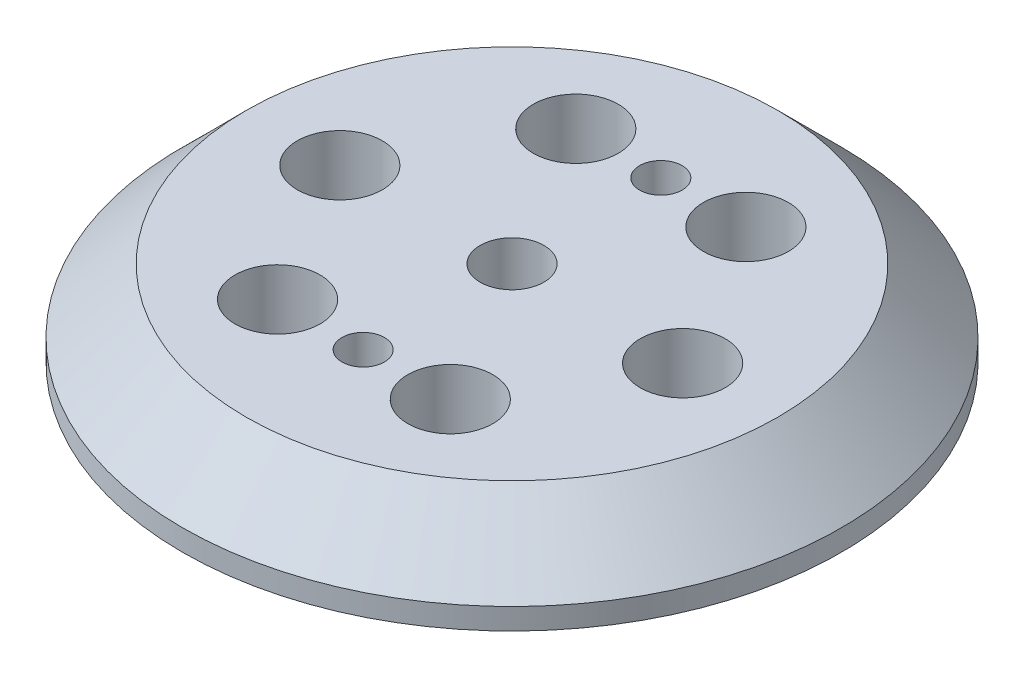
from build123d import *

# Parameters (mm, degrees)
SKETCH1_R           = 15.5
BOSS_EXTRUDE1_DEPTH = 4
CHAMFER1_SIZE       = 3
SKETCH2_R           = 2
CUT_EXTRUDE1_DEPTH  = 4
SKETCH3_R           = 1.5
CUT_EXTRUDE2_DEPTH  = 4
SKETCH4_R           = 1
CUT_EXTRUDE3_DEPTH  = 4


with BuildPart() as part:
    # Sketch1 → Boss-Extrude1 (new body)
    with BuildSketch(Plane(origin=(0, 0, 0), x_dir=(1, 0, 0), z_dir=(0, 1, 0))):
        with Locations(Location((0, 0, 0), (0, 0, 270))):
            Circle(SKETCH1_R)
    extrude(amount=BOSS_EXTRUDE1_DEPTH)

    # Chamfer1
    chamfer1_edges = [part.edges().sort_by_distance(p)[0] for p in [
        (0, 4, -15.5),
    ]]
    chamfer(chamfer1_edges, length=CHAMFER1_SIZE)

    # Sketch2 → Cut-Extrude1 (cut)
    with BuildSketch(Plane(origin=(0, 4, 0), x_dir=(1, 0, 0), z_dir=(0, 1, 0))):
        with Locations(Location((4, 7, 0), (0, 0, 270))):
            Circle(SKETCH2_R)
        with Locations(Location((-4, 7, 0), (0, 0, 270))):
            Circle(SKETCH2_R)
        with Locations(Location((8.062177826, -0.035898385, 0), (0, 0, 270))):
            Circle(SKETCH2_R)
        with Locations(Location((4.062177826, -6.964101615, 0), (0, 0, 270))):
            Circle(SKETCH2_R)
        with Locations(Location((-4.062177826, -6.964101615, 0), (0, 0, 270))):
            Circle(SKETCH2_R)
        with Locations(Location((-8.062177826, -0.035898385, 0), (0, 0, 270))):
            Circle(SKETCH2_R)
    extrude(amount=-CUT_EXTRUDE1_DEPTH, mode=Mode.SUBTRACT)

    # Sketch3 → Cut-Extrude2 (cut)
    with BuildSketch(Plane(origin=(0, 4, 0), x_dir=(1, 0, 0), z_dir=(0, 1, 0))):
        with Locations(Location((0, 0, 0), (0, 0, 270))):
            Circle(SKETCH3_R)
    extrude(amount=-CUT_EXTRUDE2_DEPTH, mode=Mode.SUBTRACT)

    # Sketch4 → Cut-Extrude3 (cut)
    with BuildSketch(Plane(origin=(0, 4, 0), x_dir=(1, 0, 0), z_dir=(0, 1, 0))):
        with Locations(Location((0, 7, 0), (0, 0, 270))):
            Circle(SKETCH4_R)
        with Locations(Location((0, -7, 0), (0, 0, 270))):
            Circle(SKETCH4_R)
    extrude(amount=-CUT_EXTRUDE3_DEPTH, mode=Mode.SUBTRACT)


solid = part.part
